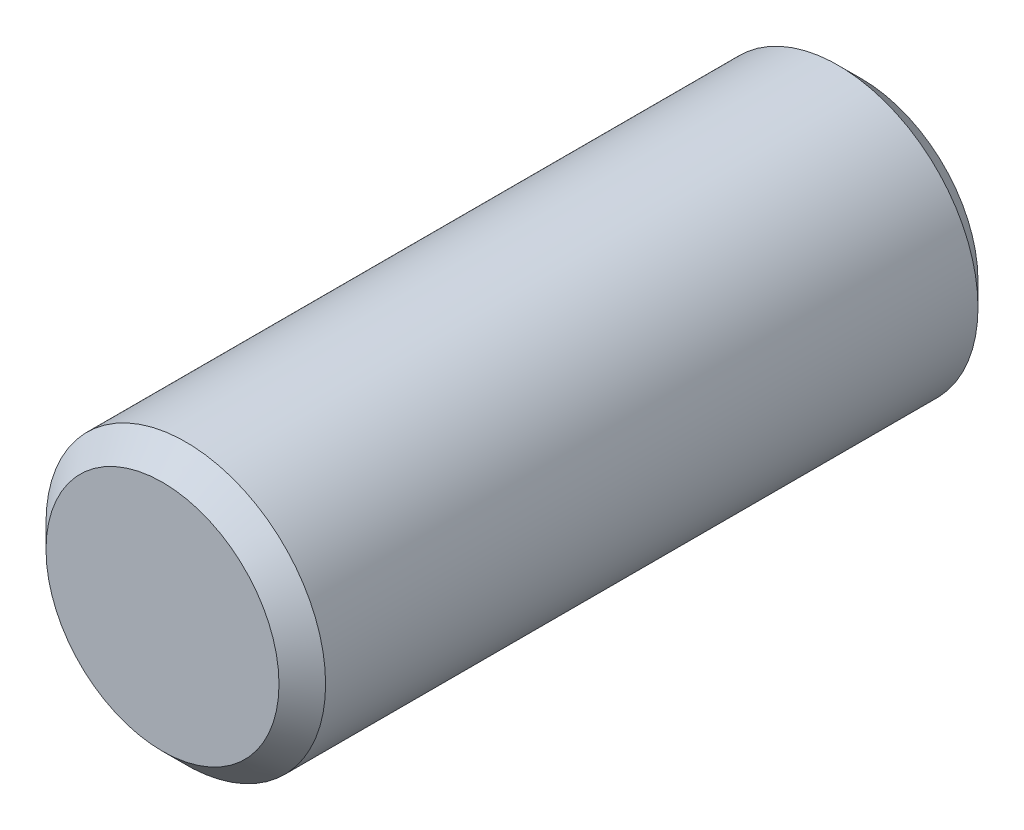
ISO-10303-21;
HEADER;
FILE_DESCRIPTION(('STEP AP214'),'2;1');
FILE_NAME('part.step','',(''),(''),'','','');
FILE_SCHEMA(('AUTOMOTIVE_DESIGN { 1 0 10303 214 1 1 1 1 }'));
ENDSEC;
DATA;
#1=APPLICATION_CONTEXT('core data for automotive mechanical design processes');
#2=APPLICATION_PROTOCOL_DEFINITION('international standard','automotive_design',2000,#1);
#3=PRODUCT_CONTEXT('',#1,'mechanical');
#4=PRODUCT('Part','Part','',(#3));
#5=PRODUCT_RELATED_PRODUCT_CATEGORY('part','',(#4));
#6=PRODUCT_DEFINITION_FORMATION('','',#4);
#7=PRODUCT_DEFINITION_CONTEXT('part definition',#1,'design');
#8=PRODUCT_DEFINITION('design','',#6,#7);
#9=PRODUCT_DEFINITION_SHAPE('','',#8);
#10=(LENGTH_UNIT() NAMED_UNIT(*) SI_UNIT(.MILLI.,.METRE.));
#11=(NAMED_UNIT(*) PLANE_ANGLE_UNIT() SI_UNIT($,.RADIAN.));
#12=(NAMED_UNIT(*) SI_UNIT($,.STERADIAN.) SOLID_ANGLE_UNIT());
#13=UNCERTAINTY_MEASURE_WITH_UNIT(LENGTH_MEASURE(1.E-05),#10,'distance_accuracy_value','');
#14=(GEOMETRIC_REPRESENTATION_CONTEXT(3) GLOBAL_UNCERTAINTY_ASSIGNED_CONTEXT((#13)) GLOBAL_UNIT_ASSIGNED_CONTEXT((#10,
#11,#12)) REPRESENTATION_CONTEXT('',''));
#15=CARTESIAN_POINT('',(0.,0.,0.));
#16=DIRECTION('',(0.,0.,1.));
#17=DIRECTION('',(1.,0.,0.));
#18=AXIS2_PLACEMENT_3D('',#15,#16,#17);
#19=CARTESIAN_POINT('',(0.,0.,15.));
#20=DIRECTION('',(0.,0.,-1.));
#21=DIRECTION('',(-1.,0.,0.));
#22=AXIS2_PLACEMENT_3D('',#19,#20,#21);
#23=CYLINDRICAL_SURFACE('',#22,3.);
#24=CARTESIAN_POINT('',(0.,0.,0.5));
#25=DIRECTION('',(0.,0.,1.));
#26=DIRECTION('',(1.,0.,0.));
#27=AXIS2_PLACEMENT_3D('',#24,#25,#26);
#28=CIRCLE('',#27,3.);
#29=CARTESIAN_POINT('',(3.,0.,0.5));
#30=VERTEX_POINT('',#29);
#31=EDGE_CURVE('E48',#30,#30,#28,.T.);
#32=ORIENTED_EDGE('',*,*,#31,.T.);
#33=EDGE_LOOP('',(#32));
#34=FACE_BOUND('',#33,.T.);
#35=CARTESIAN_POINT('',(0.,0.,14.5));
#36=DIRECTION('',(0.,0.,1.));
#37=DIRECTION('',(1.,0.,0.));
#38=AXIS2_PLACEMENT_3D('',#35,#36,#37);
#39=CIRCLE('',#38,3.);
#40=CARTESIAN_POINT('',(3.,0.,14.5));
#41=VERTEX_POINT('',#40);
#42=EDGE_CURVE('E52',#41,#41,#39,.F.);
#43=ORIENTED_EDGE('',*,*,#42,.T.);
#44=EDGE_LOOP('',(#43));
#45=FACE_BOUND('',#44,.T.);
#46=ADVANCED_FACE('F37',(#34,#45),#23,.T.);
#47=CARTESIAN_POINT('',(0.,0.,15.));
#48=DIRECTION('',(0.,0.,1.));
#49=DIRECTION('',(1.,0.,0.));
#50=AXIS2_PLACEMENT_3D('',#47,#48,#49);
#51=PLANE('',#50);
#52=CARTESIAN_POINT('',(0.,0.,15.));
#53=DIRECTION('',(0.,0.,1.));
#54=DIRECTION('',(1.,0.,0.));
#55=AXIS2_PLACEMENT_3D('',#52,#53,#54);
#56=CIRCLE('',#55,2.50000000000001);
#57=CARTESIAN_POINT('',(2.50000000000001,0.,15.));
#58=VERTEX_POINT('',#57);
#59=EDGE_CURVE('E10',#58,#58,#56,.T.);
#60=ORIENTED_EDGE('',*,*,#59,.T.);
#61=EDGE_LOOP('',(#60));
#62=FACE_BOUND('',#61,.T.);
#63=ADVANCED_FACE('F68',(#62),#51,.T.);
#64=CARTESIAN_POINT('',(0.,0.,0.));
#65=DIRECTION('',(0.,0.,1.));
#66=DIRECTION('',(1.,0.,0.));
#67=AXIS2_PLACEMENT_3D('',#64,#65,#66);
#68=PLANE('',#67);
#69=CARTESIAN_POINT('',(0.,0.,0.));
#70=DIRECTION('',(0.,0.,1.));
#71=DIRECTION('',(1.,0.,0.));
#72=AXIS2_PLACEMENT_3D('',#69,#70,#71);
#73=CIRCLE('',#72,2.5);
#74=CARTESIAN_POINT('',(2.5,0.,0.));
#75=VERTEX_POINT('',#74);
#76=EDGE_CURVE('E44',#75,#75,#73,.F.);
#77=ORIENTED_EDGE('',*,*,#76,.T.);
#78=EDGE_LOOP('',(#77));
#79=FACE_BOUND('',#78,.T.);
#80=ADVANCED_FACE('F65',(#79),#68,.F.);
#81=CARTESIAN_POINT('',(0.,0.,0.5));
#82=DIRECTION('',(0.,0.,1.));
#83=DIRECTION('',(1.,0.,0.));
#84=AXIS2_PLACEMENT_3D('',#81,#82,#83);
#85=CONICAL_SURFACE('',#84,3.,0.785398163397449);
#86=ORIENTED_EDGE('',*,*,#76,.F.);
#87=EDGE_LOOP('',(#86));
#88=FACE_BOUND('',#87,.T.);
#89=ORIENTED_EDGE('',*,*,#31,.F.);
#90=EDGE_LOOP('',(#89));
#91=FACE_BOUND('',#90,.T.);
#92=ADVANCED_FACE('F61',(#88,#91),#85,.T.);
#93=CARTESIAN_POINT('',(0.,0.,15.));
#94=DIRECTION('',(0.,0.,-1.));
#95=DIRECTION('',(-1.,0.,0.));
#96=AXIS2_PLACEMENT_3D('',#93,#94,#95);
#97=CONICAL_SURFACE('',#96,2.50000000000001,0.785398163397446);
#98=ORIENTED_EDGE('',*,*,#42,.F.);
#99=EDGE_LOOP('',(#98));
#100=FACE_BOUND('',#99,.T.);
#101=ORIENTED_EDGE('',*,*,#59,.F.);
#102=EDGE_LOOP('',(#101));
#103=FACE_BOUND('',#102,.T.);
#104=ADVANCED_FACE('F39',(#100,#103),#97,.T.);
#105=CLOSED_SHELL('',(#46,#63,#80,#92,#104));
#106=MANIFOLD_SOLID_BREP('B2',#105);
#107=ADVANCED_BREP_SHAPE_REPRESENTATION('',(#18,#106),#14);
#108=SHAPE_DEFINITION_REPRESENTATION(#9,#107);
ENDSEC;
END-ISO-10303-21;
